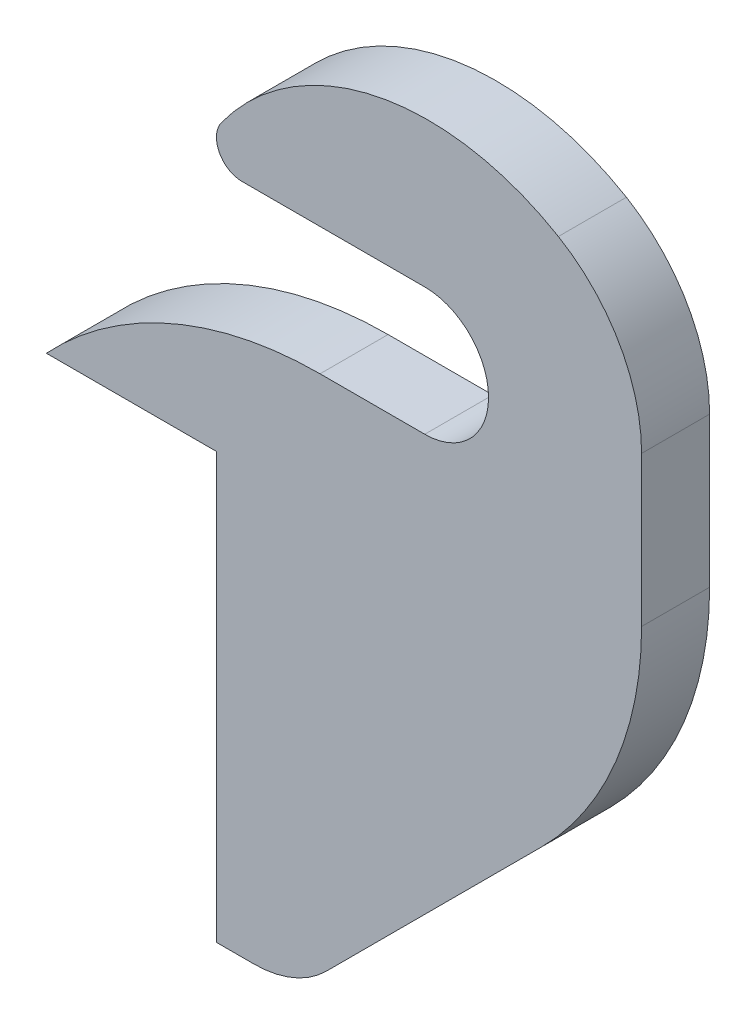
ISO-10303-21;
HEADER;
FILE_DESCRIPTION(('STEP AP214'),'2;1');
FILE_NAME('part.step','',(''),(''),'','','');
FILE_SCHEMA(('AUTOMOTIVE_DESIGN { 1 0 10303 214 1 1 1 1 }'));
ENDSEC;
DATA;
#1=APPLICATION_CONTEXT('core data for automotive mechanical design processes');
#2=APPLICATION_PROTOCOL_DEFINITION('international standard','automotive_design',2000,#1);
#3=PRODUCT_CONTEXT('',#1,'mechanical');
#4=PRODUCT('Part','Part','',(#3));
#5=PRODUCT_RELATED_PRODUCT_CATEGORY('part','',(#4));
#6=PRODUCT_DEFINITION_FORMATION('','',#4);
#7=PRODUCT_DEFINITION_CONTEXT('part definition',#1,'design');
#8=PRODUCT_DEFINITION('design','',#6,#7);
#9=PRODUCT_DEFINITION_SHAPE('','',#8);
#10=(LENGTH_UNIT() NAMED_UNIT(*) SI_UNIT(.MILLI.,.METRE.));
#11=(NAMED_UNIT(*) PLANE_ANGLE_UNIT() SI_UNIT($,.RADIAN.));
#12=(NAMED_UNIT(*) SI_UNIT($,.STERADIAN.) SOLID_ANGLE_UNIT());
#13=UNCERTAINTY_MEASURE_WITH_UNIT(LENGTH_MEASURE(1.E-05),#10,'distance_accuracy_value','');
#14=(GEOMETRIC_REPRESENTATION_CONTEXT(3) GLOBAL_UNCERTAINTY_ASSIGNED_CONTEXT((#13)) GLOBAL_UNIT_ASSIGNED_CONTEXT((#10,
#11,#12)) REPRESENTATION_CONTEXT('',''));
#15=CARTESIAN_POINT('',(0.,0.,0.));
#16=DIRECTION('',(0.,0.,1.));
#17=DIRECTION('',(1.,0.,0.));
#18=AXIS2_PLACEMENT_3D('',#15,#16,#17);
#19=CARTESIAN_POINT('',(0.,0.,4.));
#20=DIRECTION('',(1.,0.,0.));
#21=DIRECTION('',(0.,1.,0.));
#22=AXIS2_PLACEMENT_3D('',#19,#20,#21);
#23=PLANE('',#22);
#24=DIRECTION('',(0.,-1.,0.));
#25=VECTOR('',#24,1.);
#26=CARTESIAN_POINT('',(0.,0.,0.));
#27=LINE('',#26,#25);
#28=CARTESIAN_POINT('',(0.,0.,0.));
#29=VERTEX_POINT('',#28);
#30=CARTESIAN_POINT('',(0.,-25.,0.));
#31=VERTEX_POINT('',#30);
#32=EDGE_CURVE('E164',#29,#31,#27,.T.);
#33=ORIENTED_EDGE('',*,*,#32,.T.);
#34=DIRECTION('',(0.,0.,-1.));
#35=VECTOR('',#34,1.);
#36=CARTESIAN_POINT('',(0.,-25.,4.));
#37=LINE('',#36,#35);
#38=CARTESIAN_POINT('',(0.,-25.,4.));
#39=VERTEX_POINT('',#38);
#40=EDGE_CURVE('E11',#39,#31,#37,.T.);
#41=ORIENTED_EDGE('',*,*,#40,.F.);
#42=DIRECTION('',(0.,-1.,0.));
#43=VECTOR('',#42,1.);
#44=CARTESIAN_POINT('',(0.,0.,4.));
#45=LINE('',#44,#43);
#46=CARTESIAN_POINT('',(0.,0.,4.));
#47=VERTEX_POINT('',#46);
#48=EDGE_CURVE('E190',#47,#39,#45,.T.);
#49=ORIENTED_EDGE('',*,*,#48,.F.);
#50=DIRECTION('',(0.,0.,-1.));
#51=VECTOR('',#50,1.);
#52=CARTESIAN_POINT('',(0.,0.,4.));
#53=LINE('',#52,#51);
#54=EDGE_CURVE('E160',#47,#29,#53,.T.);
#55=ORIENTED_EDGE('',*,*,#54,.T.);
#56=EDGE_LOOP('',(#33,#41,#49,#55));
#57=FACE_BOUND('',#56,.T.);
#58=ADVANCED_FACE('F32',(#57),#23,.F.);
#59=CARTESIAN_POINT('',(0.,-25.,4.));
#60=DIRECTION('',(0.,1.,0.));
#61=DIRECTION('',(-1.,0.,0.));
#62=AXIS2_PLACEMENT_3D('',#59,#60,#61);
#63=PLANE('',#62);
#64=DIRECTION('',(1.,0.,0.));
#65=VECTOR('',#64,1.);
#66=CARTESIAN_POINT('',(0.,-25.,0.));
#67=LINE('',#66,#65);
#68=CARTESIAN_POINT('',(2.21320343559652,-25.,0.));
#69=VERTEX_POINT('',#68);
#70=EDGE_CURVE('E167',#31,#69,#67,.T.);
#71=ORIENTED_EDGE('',*,*,#70,.T.);
#72=DIRECTION('',(0.,0.,-1.));
#73=VECTOR('',#72,1.);
#74=CARTESIAN_POINT('',(2.21320343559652,-25.,4.));
#75=LINE('',#74,#73);
#76=CARTESIAN_POINT('',(2.21320343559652,-25.,4.));
#77=VERTEX_POINT('',#76);
#78=EDGE_CURVE('E40',#77,#69,#75,.T.);
#79=ORIENTED_EDGE('',*,*,#78,.F.);
#80=DIRECTION('',(1.,0.,0.));
#81=VECTOR('',#80,1.);
#82=CARTESIAN_POINT('',(0.,-25.,4.));
#83=LINE('',#82,#81);
#84=EDGE_CURVE('E109',#39,#77,#83,.T.);
#85=ORIENTED_EDGE('',*,*,#84,.F.);
#86=ORIENTED_EDGE('',*,*,#40,.T.);
#87=EDGE_LOOP('',(#71,#79,#85,#86));
#88=FACE_BOUND('',#87,.T.);
#89=ADVANCED_FACE('F278',(#88),#63,.F.);
#90=CARTESIAN_POINT('',(2.21320343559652,-19.,4.));
#91=DIRECTION('',(0.,0.,-1.));
#92=DIRECTION('',(-1.,0.,0.));
#93=AXIS2_PLACEMENT_3D('',#90,#91,#92);
#94=CYLINDRICAL_SURFACE('',#93,6.);
#95=CARTESIAN_POINT('',(2.21320343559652,-19.,0.));
#96=DIRECTION('',(0.,0.,1.));
#97=DIRECTION('',(1.,0.,0.));
#98=AXIS2_PLACEMENT_3D('',#95,#96,#97);
#99=CIRCLE('',#98,6.);
#100=CARTESIAN_POINT('',(6.45584412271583,-23.2426406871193,0.));
#101=VERTEX_POINT('',#100);
#102=EDGE_CURVE('E169',#69,#101,#99,.T.);
#103=ORIENTED_EDGE('',*,*,#102,.T.);
#104=DIRECTION('',(0.,0.,-1.));
#105=VECTOR('',#104,1.);
#106=CARTESIAN_POINT('',(6.45584412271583,-23.2426406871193,4.));
#107=LINE('',#106,#105);
#108=CARTESIAN_POINT('',(6.45584412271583,-23.2426406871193,4.));
#109=VERTEX_POINT('',#108);
#110=EDGE_CURVE('E215',#109,#101,#107,.T.);
#111=ORIENTED_EDGE('',*,*,#110,.F.);
#112=CARTESIAN_POINT('',(2.21320343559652,-19.,4.));
#113=DIRECTION('',(0.,0.,1.));
#114=DIRECTION('',(1.,0.,0.));
#115=AXIS2_PLACEMENT_3D('',#112,#113,#114);
#116=CIRCLE('',#115,6.);
#117=EDGE_CURVE('E223',#77,#109,#116,.T.);
#118=ORIENTED_EDGE('',*,*,#117,.F.);
#119=ORIENTED_EDGE('',*,*,#78,.T.);
#120=EDGE_LOOP('',(#103,#111,#118,#119));
#121=FACE_BOUND('',#120,.T.);
#122=ADVANCED_FACE('F221',(#121),#94,.T.);
#123=CARTESIAN_POINT('',(6.45584412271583,-23.2426406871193,4.));
#124=DIRECTION('',(-0.707106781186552,0.707106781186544,0.));
#125=DIRECTION('',(-0.707106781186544,-0.707106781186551,0.));
#126=AXIS2_PLACEMENT_3D('',#123,#124,#125);
#127=PLANE('',#126);
#128=DIRECTION('',(0.707106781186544,0.707106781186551,0.));
#129=VECTOR('',#128,1.);
#130=CARTESIAN_POINT('',(6.45584412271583,-23.2426406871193,0.));
#131=LINE('',#130,#129);
#132=CARTESIAN_POINT('',(19.142135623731,-10.5563491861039,0.));
#133=VERTEX_POINT('',#132);
#134=EDGE_CURVE('E171',#101,#133,#131,.T.);
#135=ORIENTED_EDGE('',*,*,#134,.T.);
#136=DIRECTION('',(0.,0.,-1.));
#137=VECTOR('',#136,1.);
#138=CARTESIAN_POINT('',(19.142135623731,-10.5563491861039,4.));
#139=LINE('',#138,#137);
#140=CARTESIAN_POINT('',(19.142135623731,-10.5563491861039,4.));
#141=VERTEX_POINT('',#140);
#142=EDGE_CURVE('E212',#141,#133,#139,.T.);
#143=ORIENTED_EDGE('',*,*,#142,.F.);
#144=DIRECTION('',(0.707106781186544,0.707106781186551,0.));
#145=VECTOR('',#144,1.);
#146=CARTESIAN_POINT('',(6.45584412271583,-23.2426406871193,4.));
#147=LINE('',#146,#145);
#148=EDGE_CURVE('E241',#109,#141,#147,.T.);
#149=ORIENTED_EDGE('',*,*,#148,.F.);
#150=ORIENTED_EDGE('',*,*,#110,.T.);
#151=EDGE_LOOP('',(#135,#143,#149,#150));
#152=FACE_BOUND('',#151,.T.);
#153=ADVANCED_FACE('F232',(#152),#127,.F.);
#154=CARTESIAN_POINT('',(5.,3.58578643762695,4.));
#155=DIRECTION('',(0.,0.,-1.));
#156=DIRECTION('',(-1.,0.,0.));
#157=AXIS2_PLACEMENT_3D('',#154,#155,#156);
#158=CYLINDRICAL_SURFACE('',#157,20.);
#159=CARTESIAN_POINT('',(5.,3.58578643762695,0.));
#160=DIRECTION('',(0.,0.,1.));
#161=DIRECTION('',(1.,0.,0.));
#162=AXIS2_PLACEMENT_3D('',#159,#160,#161);
#163=CIRCLE('',#162,20.);
#164=CARTESIAN_POINT('',(25.,3.58578643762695,0.));
#165=VERTEX_POINT('',#164);
#166=EDGE_CURVE('E173',#133,#165,#163,.T.);
#167=ORIENTED_EDGE('',*,*,#166,.T.);
#168=DIRECTION('',(0.,0.,-1.));
#169=VECTOR('',#168,1.);
#170=CARTESIAN_POINT('',(25.,3.58578643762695,4.));
#171=LINE('',#170,#169);
#172=CARTESIAN_POINT('',(25.,3.58578643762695,4.));
#173=VERTEX_POINT('',#172);
#174=EDGE_CURVE('E209',#173,#165,#171,.T.);
#175=ORIENTED_EDGE('',*,*,#174,.F.);
#176=CARTESIAN_POINT('',(5.,3.58578643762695,4.));
#177=DIRECTION('',(0.,0.,1.));
#178=DIRECTION('',(1.,0.,0.));
#179=AXIS2_PLACEMENT_3D('',#176,#177,#178);
#180=CIRCLE('',#179,20.);
#181=EDGE_CURVE('E238',#141,#173,#180,.T.);
#182=ORIENTED_EDGE('',*,*,#181,.F.);
#183=ORIENTED_EDGE('',*,*,#142,.T.);
#184=EDGE_LOOP('',(#167,#175,#182,#183));
#185=FACE_BOUND('',#184,.T.);
#186=ADVANCED_FACE('F236',(#185),#158,.T.);
#187=CARTESIAN_POINT('',(25.,3.58578643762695,4.));
#188=DIRECTION('',(-1.,0.,0.));
#189=DIRECTION('',(0.,0.,1.));
#190=AXIS2_PLACEMENT_3D('',#187,#188,#189);
#191=PLANE('',#190);
#192=DIRECTION('',(0.,1.,0.));
#193=VECTOR('',#192,1.);
#194=CARTESIAN_POINT('',(25.,3.58578643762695,0.));
#195=LINE('',#194,#193);
#196=CARTESIAN_POINT('',(25.,12.3991784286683,0.));
#197=VERTEX_POINT('',#196);
#198=EDGE_CURVE('E175',#165,#197,#195,.T.);
#199=ORIENTED_EDGE('',*,*,#198,.T.);
#200=DIRECTION('',(0.,0.,-1.));
#201=VECTOR('',#200,1.);
#202=CARTESIAN_POINT('',(25.,12.3991784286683,4.));
#203=LINE('',#202,#201);
#204=CARTESIAN_POINT('',(25.,12.3991784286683,4.));
#205=VERTEX_POINT('',#204);
#206=EDGE_CURVE('E206',#205,#197,#203,.T.);
#207=ORIENTED_EDGE('',*,*,#206,.F.);
#208=DIRECTION('',(0.,1.,0.));
#209=VECTOR('',#208,1.);
#210=CARTESIAN_POINT('',(25.,3.58578643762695,4.));
#211=LINE('',#210,#209);
#212=EDGE_CURVE('E240',#173,#205,#211,.T.);
#213=ORIENTED_EDGE('',*,*,#212,.F.);
#214=ORIENTED_EDGE('',*,*,#174,.T.);
#215=EDGE_LOOP('',(#199,#207,#213,#214));
#216=FACE_BOUND('',#215,.T.);
#217=ADVANCED_FACE('F291',(#216),#191,.F.);
#218=CARTESIAN_POINT('',(15.,12.3991784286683,4.));
#219=DIRECTION('',(0.,0.,-1.));
#220=DIRECTION('',(-1.,0.,0.));
#221=AXIS2_PLACEMENT_3D('',#218,#219,#220);
#222=CYLINDRICAL_SURFACE('',#221,10.);
#223=CARTESIAN_POINT('',(15.,12.3991784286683,0.));
#224=DIRECTION('',(0.,0.,1.));
#225=DIRECTION('',(1.,0.,0.));
#226=AXIS2_PLACEMENT_3D('',#223,#224,#225);
#227=CIRCLE('',#226,10.);
#228=CARTESIAN_POINT('',(20.1057085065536,20.9975352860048,0.));
#229=VERTEX_POINT('',#228);
#230=EDGE_CURVE('E177',#197,#229,#227,.T.);
#231=ORIENTED_EDGE('',*,*,#230,.T.);
#232=DIRECTION('',(0.,0.,-1.));
#233=VECTOR('',#232,1.);
#234=CARTESIAN_POINT('',(20.1057085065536,20.9975352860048,4.));
#235=LINE('',#234,#233);
#236=CARTESIAN_POINT('',(20.1057085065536,20.9975352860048,4.));
#237=VERTEX_POINT('',#236);
#238=EDGE_CURVE('E203',#237,#229,#235,.T.);
#239=ORIENTED_EDGE('',*,*,#238,.F.);
#240=CARTESIAN_POINT('',(15.,12.3991784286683,4.));
#241=DIRECTION('',(0.,0.,1.));
#242=DIRECTION('',(1.,0.,0.));
#243=AXIS2_PLACEMENT_3D('',#240,#241,#242);
#244=CIRCLE('',#243,10.);
#245=EDGE_CURVE('E243',#205,#237,#244,.T.);
#246=ORIENTED_EDGE('',*,*,#245,.F.);
#247=ORIENTED_EDGE('',*,*,#206,.T.);
#248=EDGE_LOOP('',(#231,#239,#246,#247));
#249=FACE_BOUND('',#248,.T.);
#250=ADVANCED_FACE('F294',(#249),#222,.T.);
#251=CARTESIAN_POINT('',(12.4471457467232,8.1,4.));
#252=DIRECTION('',(0.,0.,-1.));
#253=DIRECTION('',(-1.,0.,0.));
#254=AXIS2_PLACEMENT_3D('',#251,#252,#253);
#255=CYLINDRICAL_SURFACE('',#254,15.);
#256=CARTESIAN_POINT('',(12.4471457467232,8.1,0.));
#257=DIRECTION('',(0.,0.,1.));
#258=DIRECTION('',(1.,0.,0.));
#259=AXIS2_PLACEMENT_3D('',#256,#257,#258);
#260=CIRCLE('',#259,15.);
#261=CARTESIAN_POINT('',(0.28365047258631,16.8777777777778,0.));
#262=VERTEX_POINT('',#261);
#263=EDGE_CURVE('E179',#229,#262,#260,.T.);
#264=ORIENTED_EDGE('',*,*,#263,.T.);
#265=DIRECTION('',(0.,0.,-1.));
#266=VECTOR('',#265,1.);
#267=CARTESIAN_POINT('',(0.28365047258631,16.8777777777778,4.));
#268=LINE('',#267,#266);
#269=CARTESIAN_POINT('',(0.28365047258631,16.8777777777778,4.));
#270=VERTEX_POINT('',#269);
#271=EDGE_CURVE('E200',#270,#262,#268,.T.);
#272=ORIENTED_EDGE('',*,*,#271,.F.);
#273=CARTESIAN_POINT('',(12.4471457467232,8.1,4.));
#274=DIRECTION('',(0.,0.,1.));
#275=DIRECTION('',(1.,0.,0.));
#276=AXIS2_PLACEMENT_3D('',#273,#274,#275);
#277=CIRCLE('',#276,15.);
#278=EDGE_CURVE('E249',#237,#270,#277,.T.);
#279=ORIENTED_EDGE('',*,*,#278,.F.);
#280=ORIENTED_EDGE('',*,*,#238,.T.);
#281=EDGE_LOOP('',(#264,#272,#279,#280));
#282=FACE_BOUND('',#281,.T.);
#283=ADVANCED_FACE('F298',(#282),#255,.T.);
#284=CARTESIAN_POINT('',(1.5,16.,4.));
#285=DIRECTION('',(0.,0.,-1.));
#286=DIRECTION('',(-1.,0.,0.));
#287=AXIS2_PLACEMENT_3D('',#284,#285,#286);
#288=CYLINDRICAL_SURFACE('',#287,1.5);
#289=CARTESIAN_POINT('',(1.5,16.,0.));
#290=DIRECTION('',(0.,0.,1.));
#291=DIRECTION('',(1.,0.,0.));
#292=AXIS2_PLACEMENT_3D('',#289,#290,#291);
#293=CIRCLE('',#292,1.5);
#294=CARTESIAN_POINT('',(1.5,14.5,0.));
#295=VERTEX_POINT('',#294);
#296=EDGE_CURVE('E181',#262,#295,#293,.T.);
#297=ORIENTED_EDGE('',*,*,#296,.T.);
#298=DIRECTION('',(0.,0.,-1.));
#299=VECTOR('',#298,1.);
#300=CARTESIAN_POINT('',(1.5,14.5,4.));
#301=LINE('',#300,#299);
#302=CARTESIAN_POINT('',(1.5,14.5,4.));
#303=VERTEX_POINT('',#302);
#304=EDGE_CURVE('E197',#303,#295,#301,.T.);
#305=ORIENTED_EDGE('',*,*,#304,.F.);
#306=CARTESIAN_POINT('',(1.5,16.,4.));
#307=DIRECTION('',(0.,0.,1.));
#308=DIRECTION('',(1.,0.,0.));
#309=AXIS2_PLACEMENT_3D('',#306,#307,#308);
#310=CIRCLE('',#309,1.5);
#311=EDGE_CURVE('E251',#270,#303,#310,.T.);
#312=ORIENTED_EDGE('',*,*,#311,.F.);
#313=ORIENTED_EDGE('',*,*,#271,.T.);
#314=EDGE_LOOP('',(#297,#305,#312,#313));
#315=FACE_BOUND('',#314,.T.);
#316=ADVANCED_FACE('F302',(#315),#288,.T.);
#317=CARTESIAN_POINT('',(1.5,14.5,4.));
#318=DIRECTION('',(0.,1.,0.));
#319=DIRECTION('',(-1.,0.,0.));
#320=AXIS2_PLACEMENT_3D('',#317,#318,#319);
#321=PLANE('',#320);
#322=DIRECTION('',(1.,0.,0.));
#323=VECTOR('',#322,1.);
#324=CARTESIAN_POINT('',(1.5,14.5,0.));
#325=LINE('',#324,#323);
#326=CARTESIAN_POINT('',(12.25,14.5,0.));
#327=VERTEX_POINT('',#326);
#328=EDGE_CURVE('E183',#295,#327,#325,.T.);
#329=ORIENTED_EDGE('',*,*,#328,.T.);
#330=DIRECTION('',(0.,0.,-1.));
#331=VECTOR('',#330,1.);
#332=CARTESIAN_POINT('',(12.25,14.5,4.));
#333=LINE('',#332,#331);
#334=CARTESIAN_POINT('',(12.25,14.5,4.));
#335=VERTEX_POINT('',#334);
#336=EDGE_CURVE('E194',#335,#327,#333,.T.);
#337=ORIENTED_EDGE('',*,*,#336,.F.);
#338=DIRECTION('',(1.,0.,0.));
#339=VECTOR('',#338,1.);
#340=CARTESIAN_POINT('',(1.5,14.5,4.));
#341=LINE('',#340,#339);
#342=EDGE_CURVE('E253',#303,#335,#341,.T.);
#343=ORIENTED_EDGE('',*,*,#342,.F.);
#344=ORIENTED_EDGE('',*,*,#304,.T.);
#345=EDGE_LOOP('',(#329,#337,#343,#344));
#346=FACE_BOUND('',#345,.T.);
#347=ADVANCED_FACE('F259',(#346),#321,.F.);
#348=CARTESIAN_POINT('',(12.25,10.75,4.));
#349=DIRECTION('',(0.,0.,-1.));
#350=DIRECTION('',(-1.,0.,0.));
#351=AXIS2_PLACEMENT_3D('',#348,#349,#350);
#352=CYLINDRICAL_SURFACE('',#351,3.75);
#353=CARTESIAN_POINT('',(12.25,10.75,0.));
#354=DIRECTION('',(0.,0.,-1.));
#355=DIRECTION('',(-1.,0.,0.));
#356=AXIS2_PLACEMENT_3D('',#353,#354,#355);
#357=CIRCLE('',#356,3.75);
#358=CARTESIAN_POINT('',(12.25,7.,0.));
#359=VERTEX_POINT('',#358);
#360=EDGE_CURVE('E185',#327,#359,#357,.T.);
#361=ORIENTED_EDGE('',*,*,#360,.T.);
#362=DIRECTION('',(0.,0.,-1.));
#363=VECTOR('',#362,1.);
#364=CARTESIAN_POINT('',(12.25,7.,4.));
#365=LINE('',#364,#363);
#366=CARTESIAN_POINT('',(12.25,7.,4.));
#367=VERTEX_POINT('',#366);
#368=EDGE_CURVE('E155',#367,#359,#365,.T.);
#369=ORIENTED_EDGE('',*,*,#368,.F.);
#370=CARTESIAN_POINT('',(12.25,10.75,4.));
#371=DIRECTION('',(0.,0.,-1.));
#372=DIRECTION('',(-1.,0.,0.));
#373=AXIS2_PLACEMENT_3D('',#370,#371,#372);
#374=CIRCLE('',#373,3.75);
#375=EDGE_CURVE('E146',#335,#367,#374,.T.);
#376=ORIENTED_EDGE('',*,*,#375,.F.);
#377=ORIENTED_EDGE('',*,*,#336,.T.);
#378=EDGE_LOOP('',(#361,#369,#376,#377));
#379=FACE_BOUND('',#378,.T.);
#380=ADVANCED_FACE('F263',(#379),#352,.F.);
#381=CARTESIAN_POINT('',(12.25,7.,4.));
#382=DIRECTION('',(0.,-1.,0.));
#383=DIRECTION('',(1.,0.,0.));
#384=AXIS2_PLACEMENT_3D('',#381,#382,#383);
#385=PLANE('',#384);
#386=DIRECTION('',(-1.,0.,0.));
#387=VECTOR('',#386,1.);
#388=CARTESIAN_POINT('',(12.25,7.,0.));
#389=LINE('',#388,#387);
#390=CARTESIAN_POINT('',(6.09347693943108,7.,0.));
#391=VERTEX_POINT('',#390);
#392=EDGE_CURVE('E154',#359,#391,#389,.T.);
#393=ORIENTED_EDGE('',*,*,#392,.T.);
#394=DIRECTION('',(0.,0.,-1.));
#395=VECTOR('',#394,1.);
#396=CARTESIAN_POINT('',(6.09347693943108,7.,4.));
#397=LINE('',#396,#395);
#398=CARTESIAN_POINT('',(6.09347693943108,7.,4.));
#399=VERTEX_POINT('',#398);
#400=EDGE_CURVE('E151',#399,#391,#397,.T.);
#401=ORIENTED_EDGE('',*,*,#400,.F.);
#402=DIRECTION('',(-1.,0.,0.));
#403=VECTOR('',#402,1.);
#404=CARTESIAN_POINT('',(12.25,7.,4.));
#405=LINE('',#404,#403);
#406=EDGE_CURVE('E140',#367,#399,#405,.T.);
#407=ORIENTED_EDGE('',*,*,#406,.F.);
#408=ORIENTED_EDGE('',*,*,#368,.T.);
#409=EDGE_LOOP('',(#393,#401,#407,#408));
#410=FACE_BOUND('',#409,.T.);
#411=ADVANCED_FACE('F152',(#410),#385,.F.);
#412=CARTESIAN_POINT('',(6.09347693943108,-15.,4.));
#413=DIRECTION('',(0.,0.,-1.));
#414=DIRECTION('',(-1.,0.,0.));
#415=AXIS2_PLACEMENT_3D('',#412,#413,#414);
#416=CYLINDRICAL_SURFACE('',#415,22.);
#417=CARTESIAN_POINT('',(6.09347693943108,-15.,0.));
#418=DIRECTION('',(0.,0.,1.));
#419=DIRECTION('',(1.,0.,0.));
#420=AXIS2_PLACEMENT_3D('',#417,#418,#419);
#421=CIRCLE('',#420,22.);
#422=CARTESIAN_POINT('',(-10.,0.,0.));
#423=VERTEX_POINT('',#422);
#424=EDGE_CURVE('E95',#391,#423,#421,.T.);
#425=ORIENTED_EDGE('',*,*,#424,.T.);
#426=DIRECTION('',(0.,0.,-1.));
#427=VECTOR('',#426,1.);
#428=CARTESIAN_POINT('',(-10.,0.,4.));
#429=LINE('',#428,#427);
#430=CARTESIAN_POINT('',(-10.,0.,4.));
#431=VERTEX_POINT('',#430);
#432=EDGE_CURVE('E156',#431,#423,#429,.T.);
#433=ORIENTED_EDGE('',*,*,#432,.F.);
#434=CARTESIAN_POINT('',(6.09347693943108,-15.,4.));
#435=DIRECTION('',(0.,0.,1.));
#436=DIRECTION('',(1.,0.,0.));
#437=AXIS2_PLACEMENT_3D('',#434,#435,#436);
#438=CIRCLE('',#437,22.);
#439=EDGE_CURVE('E144',#399,#431,#438,.T.);
#440=ORIENTED_EDGE('',*,*,#439,.F.);
#441=ORIENTED_EDGE('',*,*,#400,.T.);
#442=EDGE_LOOP('',(#425,#433,#440,#441));
#443=FACE_BOUND('',#442,.T.);
#444=ADVANCED_FACE('F158',(#443),#416,.T.);
#445=CARTESIAN_POINT('',(0.,0.,4.));
#446=DIRECTION('',(0.,1.,0.));
#447=DIRECTION('',(-1.,0.,0.));
#448=AXIS2_PLACEMENT_3D('',#445,#446,#447);
#449=PLANE('',#448);
#450=DIRECTION('',(1.,0.,0.));
#451=VECTOR('',#450,1.);
#452=CARTESIAN_POINT('',(0.,0.,0.));
#453=LINE('',#452,#451);
#454=EDGE_CURVE('E101',#423,#29,#453,.T.);
#455=ORIENTED_EDGE('',*,*,#454,.T.);
#456=ORIENTED_EDGE('',*,*,#54,.F.);
#457=DIRECTION('',(1.,0.,0.));
#458=VECTOR('',#457,1.);
#459=CARTESIAN_POINT('',(0.,0.,4.));
#460=LINE('',#459,#458);
#461=EDGE_CURVE('E48',#431,#47,#460,.T.);
#462=ORIENTED_EDGE('',*,*,#461,.F.);
#463=ORIENTED_EDGE('',*,*,#432,.T.);
#464=EDGE_LOOP('',(#455,#456,#462,#463));
#465=FACE_BOUND('',#464,.T.);
#466=ADVANCED_FACE('F267',(#465),#449,.F.);
#467=CARTESIAN_POINT('',(2.21320343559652,-19.,4.));
#468=DIRECTION('',(0.,0.,1.));
#469=DIRECTION('',(1.,0.,0.));
#470=AXIS2_PLACEMENT_3D('',#467,#468,#469);
#471=PLANE('',#470);
#472=ORIENTED_EDGE('',*,*,#48,.T.);
#473=ORIENTED_EDGE('',*,*,#84,.T.);
#474=ORIENTED_EDGE('',*,*,#117,.T.);
#475=ORIENTED_EDGE('',*,*,#148,.T.);
#476=ORIENTED_EDGE('',*,*,#181,.T.);
#477=ORIENTED_EDGE('',*,*,#212,.T.);
#478=ORIENTED_EDGE('',*,*,#245,.T.);
#479=ORIENTED_EDGE('',*,*,#278,.T.);
#480=ORIENTED_EDGE('',*,*,#311,.T.);
#481=ORIENTED_EDGE('',*,*,#342,.T.);
#482=ORIENTED_EDGE('',*,*,#375,.T.);
#483=ORIENTED_EDGE('',*,*,#406,.T.);
#484=ORIENTED_EDGE('',*,*,#439,.T.);
#485=ORIENTED_EDGE('',*,*,#461,.T.);
#486=EDGE_LOOP('',(#472,#473,#474,#475,#476,#477,#478,#479,#480,#481,#482,#483,#484,#485));
#487=FACE_BOUND('',#486,.T.);
#488=ADVANCED_FACE('F142',(#487),#471,.T.);
#489=CARTESIAN_POINT('',(2.21320343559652,-19.,0.));
#490=DIRECTION('',(0.,0.,1.));
#491=DIRECTION('',(1.,0.,0.));
#492=AXIS2_PLACEMENT_3D('',#489,#490,#491);
#493=PLANE('',#492);
#494=ORIENTED_EDGE('',*,*,#32,.F.);
#495=ORIENTED_EDGE('',*,*,#454,.F.);
#496=ORIENTED_EDGE('',*,*,#424,.F.);
#497=ORIENTED_EDGE('',*,*,#392,.F.);
#498=ORIENTED_EDGE('',*,*,#360,.F.);
#499=ORIENTED_EDGE('',*,*,#328,.F.);
#500=ORIENTED_EDGE('',*,*,#296,.F.);
#501=ORIENTED_EDGE('',*,*,#263,.F.);
#502=ORIENTED_EDGE('',*,*,#230,.F.);
#503=ORIENTED_EDGE('',*,*,#198,.F.);
#504=ORIENTED_EDGE('',*,*,#166,.F.);
#505=ORIENTED_EDGE('',*,*,#134,.F.);
#506=ORIENTED_EDGE('',*,*,#102,.F.);
#507=ORIENTED_EDGE('',*,*,#70,.F.);
#508=EDGE_LOOP('',(#494,#495,#496,#497,#498,#499,#500,#501,#502,#503,#504,#505,#506,#507));
#509=FACE_BOUND('',#508,.T.);
#510=ADVANCED_FACE('F227',(#509),#493,.F.);
#511=CLOSED_SHELL('',(#58,#89,#122,#153,#186,#217,#250,#283,#316,#347,#380,#411,#444,#466,#488,#510));
#512=MANIFOLD_SOLID_BREP('B2',#511);
#513=ADVANCED_BREP_SHAPE_REPRESENTATION('',(#18,#512),#14);
#514=SHAPE_DEFINITION_REPRESENTATION(#9,#513);
ENDSEC;
END-ISO-10303-21;
